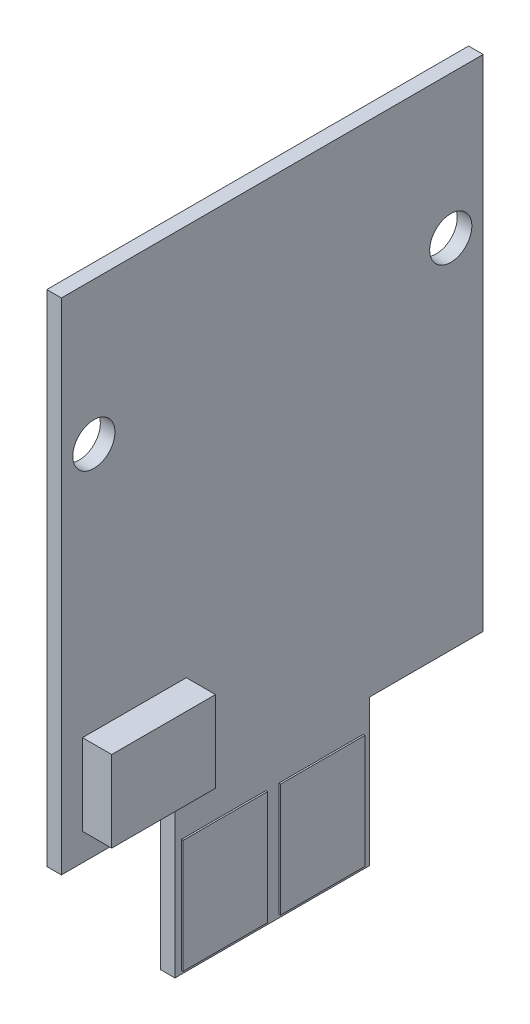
ISO-10303-21;
HEADER;
FILE_DESCRIPTION(('STEP AP214'),'2;1');
FILE_NAME('part.step','',(''),(''),'','','');
FILE_SCHEMA(('AUTOMOTIVE_DESIGN { 1 0 10303 214 1 1 1 1 }'));
ENDSEC;
DATA;
#1=APPLICATION_CONTEXT('core data for automotive mechanical design processes');
#2=APPLICATION_PROTOCOL_DEFINITION('international standard','automotive_design',2000,#1);
#3=PRODUCT_CONTEXT('',#1,'mechanical');
#4=PRODUCT('Part','Part','',(#3));
#5=PRODUCT_RELATED_PRODUCT_CATEGORY('part','',(#4));
#6=PRODUCT_DEFINITION_FORMATION('','',#4);
#7=PRODUCT_DEFINITION_CONTEXT('part definition',#1,'design');
#8=PRODUCT_DEFINITION('design','',#6,#7);
#9=PRODUCT_DEFINITION_SHAPE('','',#8);
#10=(LENGTH_UNIT() NAMED_UNIT(*) SI_UNIT(.MILLI.,.METRE.));
#11=(NAMED_UNIT(*) PLANE_ANGLE_UNIT() SI_UNIT($,.RADIAN.));
#12=(NAMED_UNIT(*) SI_UNIT($,.STERADIAN.) SOLID_ANGLE_UNIT());
#13=UNCERTAINTY_MEASURE_WITH_UNIT(LENGTH_MEASURE(1.E-05),#10,'distance_accuracy_value','');
#14=(GEOMETRIC_REPRESENTATION_CONTEXT(3) GLOBAL_UNCERTAINTY_ASSIGNED_CONTEXT((#13)) GLOBAL_UNIT_ASSIGNED_CONTEXT((#10,
#11,#12)) REPRESENTATION_CONTEXT('',''));
#15=CARTESIAN_POINT('',(0.,0.,0.));
#16=DIRECTION('',(0.,0.,1.));
#17=DIRECTION('',(1.,0.,0.));
#18=AXIS2_PLACEMENT_3D('',#15,#16,#17);
#19=CARTESIAN_POINT('',(-2.921242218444,-9.16,36.8684));
#20=DIRECTION('',(0.,-1.,0.));
#21=DIRECTION('',(0.,0.,1.));
#22=AXIS2_PLACEMENT_3D('',#19,#20,#21);
#23=PLANE('',#22);
#24=DIRECTION('',(0.,0.,1.));
#25=VECTOR('',#24,1.);
#26=CARTESIAN_POINT('',(-3.65,-9.16,42.11));
#27=LINE('',#26,#25);
#28=CARTESIAN_POINT('',(-3.65,-9.16,47.15));
#29=VERTEX_POINT('',#28);
#30=CARTESIAN_POINT('',(-3.65,-9.16,37.07));
#31=VERTEX_POINT('',#30);
#32=EDGE_CURVE('E203',#29,#31,#27,.F.);
#33=ORIENTED_EDGE('',*,*,#32,.T.);
#34=DIRECTION('',(1.,0.,0.));
#35=VECTOR('',#34,1.);
#36=CARTESIAN_POINT('',(-3.3,-9.16,37.07));
#37=LINE('',#36,#35);
#38=CARTESIAN_POINT('',(-2.95,-9.16,37.07));
#39=VERTEX_POINT('',#38);
#40=EDGE_CURVE('E199',#39,#31,#37,.F.);
#41=ORIENTED_EDGE('',*,*,#40,.F.);
#42=DIRECTION('',(0.,0.,-1.));
#43=VECTOR('',#42,1.);
#44=CARTESIAN_POINT('',(-2.95,-9.16,42.11));
#45=LINE('',#44,#43);
#46=CARTESIAN_POINT('',(-2.95,-9.16,47.15));
#47=VERTEX_POINT('',#46);
#48=EDGE_CURVE('E201',#39,#47,#45,.F.);
#49=ORIENTED_EDGE('',*,*,#48,.T.);
#50=DIRECTION('',(-1.,0.,0.));
#51=VECTOR('',#50,1.);
#52=CARTESIAN_POINT('',(-3.3,-9.16,47.15));
#53=LINE('',#52,#51);
#54=EDGE_CURVE('E208',#29,#47,#53,.F.);
#55=ORIENTED_EDGE('',*,*,#54,.F.);
#56=EDGE_LOOP('',(#33,#41,#49,#55));
#57=FACE_BOUND('',#56,.T.);
#58=ADVANCED_FACE('F16',(#57),#23,.T.);
#59=CARTESIAN_POINT('',(-2.921242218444,-4.66,47.3516));
#60=DIRECTION('',(0.,1.,0.));
#61=DIRECTION('',(0.,0.,-1.));
#62=AXIS2_PLACEMENT_3D('',#59,#60,#61);
#63=PLANE('',#62);
#64=DIRECTION('',(0.,0.,-1.));
#65=VECTOR('',#64,1.);
#66=CARTESIAN_POINT('',(-3.65,-4.66,42.11));
#67=LINE('',#66,#65);
#68=CARTESIAN_POINT('',(-3.65,-4.66,37.07));
#69=VERTEX_POINT('',#68);
#70=CARTESIAN_POINT('',(-3.65,-4.66,47.15));
#71=VERTEX_POINT('',#70);
#72=EDGE_CURVE('E234',#69,#71,#67,.F.);
#73=ORIENTED_EDGE('',*,*,#72,.T.);
#74=DIRECTION('',(1.,0.,0.));
#75=VECTOR('',#74,1.);
#76=CARTESIAN_POINT('',(-3.3,-4.66,47.15));
#77=LINE('',#76,#75);
#78=CARTESIAN_POINT('',(-2.95,-4.66,47.15));
#79=VERTEX_POINT('',#78);
#80=EDGE_CURVE('E239',#79,#71,#77,.F.);
#81=ORIENTED_EDGE('',*,*,#80,.F.);
#82=DIRECTION('',(0.,0.,1.));
#83=VECTOR('',#82,1.);
#84=CARTESIAN_POINT('',(-2.95,-4.66,42.11));
#85=LINE('',#84,#83);
#86=CARTESIAN_POINT('',(-2.95,-4.66,37.07));
#87=VERTEX_POINT('',#86);
#88=EDGE_CURVE('E224',#79,#87,#85,.F.);
#89=ORIENTED_EDGE('',*,*,#88,.T.);
#90=DIRECTION('',(-1.,0.,0.));
#91=VECTOR('',#90,1.);
#92=CARTESIAN_POINT('',(-3.3,-4.66,37.07));
#93=LINE('',#92,#91);
#94=EDGE_CURVE('E217',#69,#87,#93,.F.);
#95=ORIENTED_EDGE('',*,*,#94,.F.);
#96=EDGE_LOOP('',(#73,#81,#89,#95));
#97=FACE_BOUND('',#96,.T.);
#98=ADVANCED_FACE('F387',(#97),#63,.T.);
#99=CARTESIAN_POINT('',(-2.95,-9.5,36.8684));
#100=DIRECTION('',(-1.,0.,0.));
#101=DIRECTION('',(0.,0.,1.));
#102=AXIS2_PLACEMENT_3D('',#99,#100,#101);
#103=PLANE('',#102);
#104=DIRECTION('',(0.,0.,-1.));
#105=VECTOR('',#104,1.);
#106=CARTESIAN_POINT('',(-2.95,-9.4,42.11));
#107=LINE('',#106,#105);
#108=CARTESIAN_POINT('',(-2.95,-9.4,37.07));
#109=VERTEX_POINT('',#108);
#110=CARTESIAN_POINT('',(-2.95,-9.4,47.15));
#111=VERTEX_POINT('',#110);
#112=EDGE_CURVE('E378',#109,#111,#107,.F.);
#113=ORIENTED_EDGE('',*,*,#112,.T.);
#114=DIRECTION('',(0.,1.,0.));
#115=VECTOR('',#114,1.);
#116=CARTESIAN_POINT('',(-2.95,-6.9,47.15));
#117=LINE('',#116,#115);
#118=EDGE_CURVE('E216',#47,#111,#117,.F.);
#119=ORIENTED_EDGE('',*,*,#118,.F.);
#120=ORIENTED_EDGE('',*,*,#48,.F.);
#121=DIRECTION('',(0.,1.,0.));
#122=VECTOR('',#121,1.);
#123=CARTESIAN_POINT('',(-2.95,-6.9,37.07));
#124=LINE('',#123,#122);
#125=EDGE_CURVE('E214',#39,#109,#124,.F.);
#126=ORIENTED_EDGE('',*,*,#125,.T.);
#127=EDGE_LOOP('',(#113,#119,#120,#126));
#128=FACE_BOUND('',#127,.T.);
#129=ADVANCED_FACE('F213',(#128),#103,.T.);
#130=CARTESIAN_POINT('',(-3.65,-9.25,36.8684));
#131=DIRECTION('',(-1.,0.,0.));
#132=DIRECTION('',(0.,0.,1.));
#133=AXIS2_PLACEMENT_3D('',#130,#131,#132);
#134=PLANE('',#133);
#135=DIRECTION('',(0.,-1.,0.));
#136=VECTOR('',#135,1.);
#137=CARTESIAN_POINT('',(-3.65,-6.9,47.15));
#138=LINE('',#137,#136);
#139=EDGE_CURVE('E370',#29,#71,#138,.F.);
#140=ORIENTED_EDGE('',*,*,#139,.T.);
#141=ORIENTED_EDGE('',*,*,#72,.F.);
#142=DIRECTION('',(0.,1.,0.));
#143=VECTOR('',#142,1.);
#144=CARTESIAN_POINT('',(-3.65,-6.9,37.07));
#145=LINE('',#144,#143);
#146=EDGE_CURVE('E227',#69,#31,#145,.F.);
#147=ORIENTED_EDGE('',*,*,#146,.T.);
#148=ORIENTED_EDGE('',*,*,#32,.F.);
#149=EDGE_LOOP('',(#140,#141,#147,#148));
#150=FACE_BOUND('',#149,.T.);
#151=ADVANCED_FACE('F382',(#150),#134,.T.);
#152=CARTESIAN_POINT('',(-2.95,-9.5,36.8684));
#153=DIRECTION('',(-1.,0.,0.));
#154=DIRECTION('',(0.,0.,1.));
#155=AXIS2_PLACEMENT_3D('',#152,#153,#154);
#156=PLANE('',#155);
#157=DIRECTION('',(0.,0.,1.));
#158=VECTOR('',#157,1.);
#159=CARTESIAN_POINT('',(-2.95,-4.4,42.11));
#160=LINE('',#159,#158);
#161=CARTESIAN_POINT('',(-2.95,-4.4,47.15));
#162=VERTEX_POINT('',#161);
#163=CARTESIAN_POINT('',(-2.95,-4.4,37.07));
#164=VERTEX_POINT('',#163);
#165=EDGE_CURVE('E364',#162,#164,#160,.F.);
#166=ORIENTED_EDGE('',*,*,#165,.T.);
#167=DIRECTION('',(0.,1.,0.));
#168=VECTOR('',#167,1.);
#169=CARTESIAN_POINT('',(-2.95,-6.9,37.07));
#170=LINE('',#169,#168);
#171=EDGE_CURVE('E223',#164,#87,#170,.F.);
#172=ORIENTED_EDGE('',*,*,#171,.T.);
#173=ORIENTED_EDGE('',*,*,#88,.F.);
#174=DIRECTION('',(0.,-1.,0.));
#175=VECTOR('',#174,1.);
#176=CARTESIAN_POINT('',(-2.95,-6.9,47.15));
#177=LINE('',#176,#175);
#178=EDGE_CURVE('E376',#79,#162,#177,.F.);
#179=ORIENTED_EDGE('',*,*,#178,.T.);
#180=EDGE_LOOP('',(#166,#172,#173,#179));
#181=FACE_BOUND('',#180,.T.);
#182=ADVANCED_FACE('F390',(#181),#156,.T.);
#183=CARTESIAN_POINT('',(-1.916,-4.3,37.07));
#184=DIRECTION('',(0.,0.,-1.));
#185=DIRECTION('',(0.,-1.,0.));
#186=AXIS2_PLACEMENT_3D('',#183,#184,#185);
#187=PLANE('',#186);
#188=ORIENTED_EDGE('',*,*,#94,.T.);
#189=ORIENTED_EDGE('',*,*,#171,.F.);
#190=DIRECTION('',(-1.,0.,0.));
#191=VECTOR('',#190,1.);
#192=CARTESIAN_POINT('',(-2.45,-4.4,37.07));
#193=LINE('',#192,#191);
#194=CARTESIAN_POINT('',(-1.95,-4.4,37.07));
#195=VERTEX_POINT('',#194);
#196=EDGE_CURVE('E361',#164,#195,#193,.F.);
#197=ORIENTED_EDGE('',*,*,#196,.T.);
#198=DIRECTION('',(0.,1.,0.));
#199=VECTOR('',#198,1.);
#200=CARTESIAN_POINT('',(-1.95,-5.55,37.07));
#201=LINE('',#200,#199);
#202=CARTESIAN_POINT('',(-1.95,-9.4,37.07));
#203=VERTEX_POINT('',#202);
#204=EDGE_CURVE('E359',#195,#203,#201,.F.);
#205=ORIENTED_EDGE('',*,*,#204,.T.);
#206=DIRECTION('',(1.,0.,0.));
#207=VECTOR('',#206,1.);
#208=CARTESIAN_POINT('',(-2.45,-9.4,37.07));
#209=LINE('',#208,#207);
#210=EDGE_CURVE('E222',#203,#109,#209,.F.);
#211=ORIENTED_EDGE('',*,*,#210,.T.);
#212=ORIENTED_EDGE('',*,*,#125,.F.);
#213=ORIENTED_EDGE('',*,*,#40,.T.);
#214=ORIENTED_EDGE('',*,*,#146,.F.);
#215=EDGE_LOOP('',(#188,#189,#197,#205,#211,#212,#213,#214));
#216=FACE_BOUND('',#215,.T.);
#217=ADVANCED_FACE('F220',(#216),#187,.T.);
#218=CARTESIAN_POINT('',(-1.921242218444,-9.4,36.8684));
#219=DIRECTION('',(0.,-1.,0.));
#220=DIRECTION('',(0.,0.,1.));
#221=AXIS2_PLACEMENT_3D('',#218,#219,#220);
#222=PLANE('',#221);
#223=ORIENTED_EDGE('',*,*,#112,.F.);
#224=ORIENTED_EDGE('',*,*,#210,.F.);
#225=DIRECTION('',(0.,0.,-1.));
#226=VECTOR('',#225,1.);
#227=CARTESIAN_POINT('',(-1.95,-9.4,43.35));
#228=LINE('',#227,#226);
#229=CARTESIAN_POINT('',(-1.95,-9.4,47.15));
#230=VERTEX_POINT('',#229);
#231=EDGE_CURVE('E356',#203,#230,#228,.F.);
#232=ORIENTED_EDGE('',*,*,#231,.T.);
#233=DIRECTION('',(1.,0.,0.));
#234=VECTOR('',#233,1.);
#235=CARTESIAN_POINT('',(-2.8,-9.4,47.15));
#236=LINE('',#235,#234);
#237=EDGE_CURVE('E373',#230,#111,#236,.F.);
#238=ORIENTED_EDGE('',*,*,#237,.T.);
#239=EDGE_LOOP('',(#223,#224,#232,#238));
#240=FACE_BOUND('',#239,.T.);
#241=ADVANCED_FACE('F402',(#240),#222,.T.);
#242=CARTESIAN_POINT('',(-1.916,-9.5,47.15));
#243=DIRECTION('',(0.,0.,1.));
#244=DIRECTION('',(0.,1.,0.));
#245=AXIS2_PLACEMENT_3D('',#242,#243,#244);
#246=PLANE('',#245);
#247=ORIENTED_EDGE('',*,*,#54,.T.);
#248=ORIENTED_EDGE('',*,*,#118,.T.);
#249=ORIENTED_EDGE('',*,*,#237,.F.);
#250=DIRECTION('',(0.,-1.,0.));
#251=VECTOR('',#250,1.);
#252=CARTESIAN_POINT('',(-1.95,-5.55,47.15));
#253=LINE('',#252,#251);
#254=CARTESIAN_POINT('',(-1.95,-4.4,47.15));
#255=VERTEX_POINT('',#254);
#256=EDGE_CURVE('E353',#230,#255,#253,.F.);
#257=ORIENTED_EDGE('',*,*,#256,.T.);
#258=DIRECTION('',(1.,0.,0.));
#259=VECTOR('',#258,1.);
#260=CARTESIAN_POINT('',(-2.45,-4.4,47.15));
#261=LINE('',#260,#259);
#262=EDGE_CURVE('E367',#255,#162,#261,.F.);
#263=ORIENTED_EDGE('',*,*,#262,.T.);
#264=ORIENTED_EDGE('',*,*,#178,.F.);
#265=ORIENTED_EDGE('',*,*,#80,.T.);
#266=ORIENTED_EDGE('',*,*,#139,.F.);
#267=EDGE_LOOP('',(#247,#248,#249,#257,#263,#264,#265,#266));
#268=FACE_BOUND('',#267,.T.);
#269=ADVANCED_FACE('F396',(#268),#246,.T.);
#270=CARTESIAN_POINT('',(-1.921242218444,-4.4,47.3516));
#271=DIRECTION('',(0.,1.,0.));
#272=DIRECTION('',(0.,0.,-1.));
#273=AXIS2_PLACEMENT_3D('',#270,#271,#272);
#274=PLANE('',#273);
#275=ORIENTED_EDGE('',*,*,#165,.F.);
#276=ORIENTED_EDGE('',*,*,#262,.F.);
#277=DIRECTION('',(0.,0.,1.));
#278=VECTOR('',#277,1.);
#279=CARTESIAN_POINT('',(-1.95,-4.4,43.35));
#280=LINE('',#279,#278);
#281=EDGE_CURVE('E350',#255,#195,#280,.F.);
#282=ORIENTED_EDGE('',*,*,#281,.T.);
#283=ORIENTED_EDGE('',*,*,#196,.F.);
#284=EDGE_LOOP('',(#275,#276,#282,#283));
#285=FACE_BOUND('',#284,.T.);
#286=ADVANCED_FACE('F393',(#285),#274,.T.);
#287=CARTESIAN_POINT('',(-1.45,-15.47,40.438));
#288=DIRECTION('',(1.,0.,0.));
#289=DIRECTION('',(0.,1.,0.));
#290=AXIS2_PLACEMENT_3D('',#287,#288,#289);
#291=PLANE('',#290);
#292=DIRECTION('',(0.,1.,0.));
#293=VECTOR('',#292,1.);
#294=CARTESIAN_POINT('',(-1.45,-13.65,43.15));
#295=LINE('',#294,#293);
#296=CARTESIAN_POINT('',(-1.45,-11.9,43.15));
#297=VERTEX_POINT('',#296);
#298=CARTESIAN_POINT('',(-1.45,-15.4,43.15));
#299=VERTEX_POINT('',#298);
#300=EDGE_CURVE('E296',#297,#299,#295,.F.);
#301=ORIENTED_EDGE('',*,*,#300,.T.);
#302=DIRECTION('',(0.,0.,1.));
#303=VECTOR('',#302,1.);
#304=CARTESIAN_POINT('',(-1.45,-15.4,41.85));
#305=LINE('',#304,#303);
#306=CARTESIAN_POINT('',(-1.45,-15.4,40.55));
#307=VERTEX_POINT('',#306);
#308=EDGE_CURVE('E290',#299,#307,#305,.F.);
#309=ORIENTED_EDGE('',*,*,#308,.T.);
#310=DIRECTION('',(0.,-1.,0.));
#311=VECTOR('',#310,1.);
#312=CARTESIAN_POINT('',(-1.45,-13.65,40.55));
#313=LINE('',#312,#311);
#314=CARTESIAN_POINT('',(-1.45,-11.9,40.55));
#315=VERTEX_POINT('',#314);
#316=EDGE_CURVE('E306',#307,#315,#313,.F.);
#317=ORIENTED_EDGE('',*,*,#316,.T.);
#318=DIRECTION('',(0.,0.,-1.));
#319=VECTOR('',#318,1.);
#320=CARTESIAN_POINT('',(-1.45,-11.9,41.85));
#321=LINE('',#320,#319);
#322=EDGE_CURVE('E301',#315,#297,#321,.F.);
#323=ORIENTED_EDGE('',*,*,#322,.T.);
#324=EDGE_LOOP('',(#301,#309,#317,#323));
#325=FACE_BOUND('',#324,.T.);
#326=ADVANCED_FACE('F648',(#325),#291,.T.);
#327=CARTESIAN_POINT('',(-1.45,-15.47,40.438));
#328=DIRECTION('',(1.,0.,0.));
#329=DIRECTION('',(0.,1.,0.));
#330=AXIS2_PLACEMENT_3D('',#327,#328,#329);
#331=PLANE('',#330);
#332=DIRECTION('',(0.,0.,-1.));
#333=VECTOR('',#332,1.);
#334=CARTESIAN_POINT('',(-1.45,-11.9,44.85));
#335=LINE('',#334,#333);
#336=CARTESIAN_POINT('',(-1.45,-11.9,43.55));
#337=VERTEX_POINT('',#336);
#338=CARTESIAN_POINT('',(-1.45,-11.9,46.15));
#339=VERTEX_POINT('',#338);
#340=EDGE_CURVE('E275',#337,#339,#335,.F.);
#341=ORIENTED_EDGE('',*,*,#340,.T.);
#342=DIRECTION('',(0.,1.,0.));
#343=VECTOR('',#342,1.);
#344=CARTESIAN_POINT('',(-1.45,-13.65,46.15));
#345=LINE('',#344,#343);
#346=CARTESIAN_POINT('',(-1.45,-15.4,46.15));
#347=VERTEX_POINT('',#346);
#348=EDGE_CURVE('E262',#339,#347,#345,.F.);
#349=ORIENTED_EDGE('',*,*,#348,.T.);
#350=DIRECTION('',(0.,0.,1.));
#351=VECTOR('',#350,1.);
#352=CARTESIAN_POINT('',(-1.45,-15.4,44.85));
#353=LINE('',#352,#351);
#354=CARTESIAN_POINT('',(-1.45,-15.4,43.55));
#355=VERTEX_POINT('',#354);
#356=EDGE_CURVE('E285',#347,#355,#353,.F.);
#357=ORIENTED_EDGE('',*,*,#356,.T.);
#358=DIRECTION('',(0.,-1.,0.));
#359=VECTOR('',#358,1.);
#360=CARTESIAN_POINT('',(-1.45,-13.65,43.55));
#361=LINE('',#360,#359);
#362=EDGE_CURVE('E280',#355,#337,#361,.F.);
#363=ORIENTED_EDGE('',*,*,#362,.T.);
#364=EDGE_LOOP('',(#341,#349,#357,#363));
#365=FACE_BOUND('',#364,.T.);
#366=ADVANCED_FACE('F636',(#365),#331,.T.);
#367=CARTESIAN_POINT('',(-1.95,4.798,50.11));
#368=DIRECTION('',(-1.,0.,0.));
#369=DIRECTION('',(0.,0.,-1.));
#370=AXIS2_PLACEMENT_3D('',#367,#368,#369);
#371=PLANE('',#370);
#372=ORIENTED_EDGE('',*,*,#256,.F.);
#373=ORIENTED_EDGE('',*,*,#231,.F.);
#374=ORIENTED_EDGE('',*,*,#204,.F.);
#375=ORIENTED_EDGE('',*,*,#281,.F.);
#376=EDGE_LOOP('',(#372,#373,#374,#375));
#377=FACE_BOUND('',#376,.T.);
#378=CARTESIAN_POINT('',(-1.95,0.,48.85));
#379=DIRECTION('',(1.,0.,0.));
#380=DIRECTION('',(0.,0.,-1.));
#381=AXIS2_PLACEMENT_3D('',#378,#379,#380);
#382=CIRCLE('',#381,0.65);
#383=CARTESIAN_POINT('',(-1.95,0.,48.2));
#384=VERTEX_POINT('',#383);
#385=EDGE_CURVE('E250',#384,#384,#382,.T.);
#386=ORIENTED_EDGE('',*,*,#385,.T.);
#387=EDGE_LOOP('',(#386));
#388=FACE_BOUND('',#387,.T.);
#389=CARTESIAN_POINT('',(-1.95,0.,37.85));
#390=DIRECTION('',(-1.,0.,0.));
#391=DIRECTION('',(0.,0.,1.));
#392=AXIS2_PLACEMENT_3D('',#389,#390,#391);
#393=CIRCLE('',#392,0.65);
#394=CARTESIAN_POINT('',(-1.95,0.,38.5));
#395=VERTEX_POINT('',#394);
#396=EDGE_CURVE('E20',#395,#395,#393,.F.);
#397=ORIENTED_EDGE('',*,*,#396,.T.);
#398=EDGE_LOOP('',(#397));
#399=FACE_BOUND('',#398,.T.);
#400=DIRECTION('',(0.,1.,0.));
#401=VECTOR('',#400,1.);
#402=CARTESIAN_POINT('',(-1.95,-13.25,40.35));
#403=LINE('',#402,#401);
#404=CARTESIAN_POINT('',(-1.95,-11.,40.35));
#405=VERTEX_POINT('',#404);
#406=CARTESIAN_POINT('',(-1.95,-15.5,40.35));
#407=VERTEX_POINT('',#406);
#408=EDGE_CURVE('E327',#405,#407,#403,.F.);
#409=ORIENTED_EDGE('',*,*,#408,.T.);
#410=DIRECTION('',(0.,0.,-1.));
#411=VECTOR('',#410,1.);
#412=CARTESIAN_POINT('',(-1.95,-15.5,43.35));
#413=LINE('',#412,#411);
#414=CARTESIAN_POINT('',(-1.95,-15.5,46.35));
#415=VERTEX_POINT('',#414);
#416=EDGE_CURVE('E322',#407,#415,#413,.F.);
#417=ORIENTED_EDGE('',*,*,#416,.T.);
#418=DIRECTION('',(0.,-1.,0.));
#419=VECTOR('',#418,1.);
#420=CARTESIAN_POINT('',(-1.95,-13.25,46.35));
#421=LINE('',#420,#419);
#422=CARTESIAN_POINT('',(-1.95,-11.,46.35));
#423=VERTEX_POINT('',#422);
#424=EDGE_CURVE('E317',#415,#423,#421,.F.);
#425=ORIENTED_EDGE('',*,*,#424,.T.);
#426=DIRECTION('',(0.,0.,-1.));
#427=VECTOR('',#426,1.);
#428=CARTESIAN_POINT('',(-1.95,-11.,43.35));
#429=LINE('',#428,#427);
#430=CARTESIAN_POINT('',(-1.95,-11.,49.85));
#431=VERTEX_POINT('',#430);
#432=EDGE_CURVE('E311',#423,#431,#429,.F.);
#433=ORIENTED_EDGE('',*,*,#432,.T.);
#434=DIRECTION('',(0.,-1.,0.));
#435=VECTOR('',#434,1.);
#436=CARTESIAN_POINT('',(-1.95,-3.3,49.85));
#437=LINE('',#436,#435);
#438=CARTESIAN_POINT('',(-1.95,4.4,49.85));
#439=VERTEX_POINT('',#438);
#440=EDGE_CURVE('E347',#431,#439,#437,.F.);
#441=ORIENTED_EDGE('',*,*,#440,.T.);
#442=DIRECTION('',(0.,0.,1.));
#443=VECTOR('',#442,1.);
#444=CARTESIAN_POINT('',(-1.95,4.4,43.35));
#445=LINE('',#444,#443);
#446=CARTESIAN_POINT('',(-1.95,4.4,36.85));
#447=VERTEX_POINT('',#446);
#448=EDGE_CURVE('E345',#439,#447,#445,.F.);
#449=ORIENTED_EDGE('',*,*,#448,.T.);
#450=DIRECTION('',(0.,1.,0.));
#451=VECTOR('',#450,1.);
#452=CARTESIAN_POINT('',(-1.95,-3.3,36.85));
#453=LINE('',#452,#451);
#454=CARTESIAN_POINT('',(-1.95,-11.,36.85));
#455=VERTEX_POINT('',#454);
#456=EDGE_CURVE('E337',#447,#455,#453,.F.);
#457=ORIENTED_EDGE('',*,*,#456,.T.);
#458=DIRECTION('',(0.,0.,-1.));
#459=VECTOR('',#458,1.);
#460=CARTESIAN_POINT('',(-1.95,-11.,43.35));
#461=LINE('',#460,#459);
#462=EDGE_CURVE('E332',#455,#405,#461,.F.);
#463=ORIENTED_EDGE('',*,*,#462,.T.);
#464=EDGE_LOOP('',(#409,#417,#425,#433,#441,#449,#457,#463));
#465=FACE_BOUND('',#464,.T.);
#466=ADVANCED_FACE('F400',(#377,#388,#399,#465),#371,.T.);
#467=CARTESIAN_POINT('',(-0.6,-10.21,49.264));
#468=DIRECTION('',(1.,0.,0.));
#469=DIRECTION('',(0.,0.,-1.));
#470=AXIS2_PLACEMENT_3D('',#467,#468,#469);
#471=PLANE('',#470);
#472=DIRECTION('',(0.,-1.,0.));
#473=VECTOR('',#472,1.);
#474=CARTESIAN_POINT('',(-0.6,-8.91,46.));
#475=LINE('',#474,#473);
#476=CARTESIAN_POINT('',(-0.6,-10.16,46.));
#477=VERTEX_POINT('',#476);
#478=CARTESIAN_POINT('',(-0.6,-7.66,46.));
#479=VERTEX_POINT('',#478);
#480=EDGE_CURVE('E482',#477,#479,#475,.F.);
#481=ORIENTED_EDGE('',*,*,#480,.T.);
#482=DIRECTION('',(0.,0.,-1.));
#483=VECTOR('',#482,1.);
#484=CARTESIAN_POINT('',(-0.6,-7.66,47.6));
#485=LINE('',#484,#483);
#486=CARTESIAN_POINT('',(-0.6,-7.66,49.2));
#487=VERTEX_POINT('',#486);
#488=EDGE_CURVE('E478',#479,#487,#485,.F.);
#489=ORIENTED_EDGE('',*,*,#488,.T.);
#490=DIRECTION('',(0.,1.,0.));
#491=VECTOR('',#490,1.);
#492=CARTESIAN_POINT('',(-0.6,-8.91,49.2));
#493=LINE('',#492,#491);
#494=CARTESIAN_POINT('',(-0.6,-10.16,49.2));
#495=VERTEX_POINT('',#494);
#496=EDGE_CURVE('E252',#487,#495,#493,.F.);
#497=ORIENTED_EDGE('',*,*,#496,.T.);
#498=DIRECTION('',(0.,0.,1.));
#499=VECTOR('',#498,1.);
#500=CARTESIAN_POINT('',(-0.6,-10.16,47.6));
#501=LINE('',#500,#499);
#502=EDGE_CURVE('E487',#495,#477,#501,.F.);
#503=ORIENTED_EDGE('',*,*,#502,.T.);
#504=EDGE_LOOP('',(#481,#489,#497,#503));
#505=FACE_BOUND('',#504,.T.);
#506=ADVANCED_FACE('F539',(#505),#471,.T.);
#507=CARTESIAN_POINT('',(-1.471242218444,-11.308,49.85));
#508=DIRECTION('',(0.,0.,1.));
#509=DIRECTION('',(0.,1.,0.));
#510=AXIS2_PLACEMENT_3D('',#507,#508,#509);
#511=PLANE('',#510);
#512=DIRECTION('',(0.,1.,0.));
#513=VECTOR('',#512,1.);
#514=CARTESIAN_POINT('',(-1.5,-5.55,49.85));
#515=LINE('',#514,#513);
#516=CARTESIAN_POINT('',(-1.5,-11.,49.85));
#517=VERTEX_POINT('',#516);
#518=CARTESIAN_POINT('',(-1.5,4.4,49.85));
#519=VERTEX_POINT('',#518);
#520=EDGE_CURVE('E472',#517,#519,#515,.T.);
#521=ORIENTED_EDGE('',*,*,#520,.T.);
#522=DIRECTION('',(1.,0.,0.));
#523=VECTOR('',#522,1.);
#524=CARTESIAN_POINT('',(-1.725,4.4,49.85));
#525=LINE('',#524,#523);
#526=EDGE_CURVE('E342',#519,#439,#525,.F.);
#527=ORIENTED_EDGE('',*,*,#526,.T.);
#528=ORIENTED_EDGE('',*,*,#440,.F.);
#529=DIRECTION('',(-1.,0.,0.));
#530=VECTOR('',#529,1.);
#531=CARTESIAN_POINT('',(-1.725,-11.,49.85));
#532=LINE('',#531,#530);
#533=EDGE_CURVE('E308',#431,#517,#532,.F.);
#534=ORIENTED_EDGE('',*,*,#533,.T.);
#535=EDGE_LOOP('',(#521,#527,#528,#534));
#536=FACE_BOUND('',#535,.T.);
#537=ADVANCED_FACE('F537',(#536),#511,.T.);
#538=CARTESIAN_POINT('',(-1.471242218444,4.4,50.11));
#539=DIRECTION('',(0.,1.,0.));
#540=DIRECTION('',(0.,0.,-1.));
#541=AXIS2_PLACEMENT_3D('',#538,#539,#540);
#542=PLANE('',#541);
#543=DIRECTION('',(0.,0.,-1.));
#544=VECTOR('',#543,1.);
#545=CARTESIAN_POINT('',(-1.5,4.4,43.35));
#546=LINE('',#545,#544);
#547=CARTESIAN_POINT('',(-1.5,4.4,36.85));
#548=VERTEX_POINT('',#547);
#549=EDGE_CURVE('E469',#519,#548,#546,.T.);
#550=ORIENTED_EDGE('',*,*,#549,.T.);
#551=DIRECTION('',(1.,0.,0.));
#552=VECTOR('',#551,1.);
#553=CARTESIAN_POINT('',(-1.725,4.4,36.85));
#554=LINE('',#553,#552);
#555=EDGE_CURVE('E339',#548,#447,#554,.F.);
#556=ORIENTED_EDGE('',*,*,#555,.T.);
#557=ORIENTED_EDGE('',*,*,#448,.F.);
#558=ORIENTED_EDGE('',*,*,#526,.F.);
#559=EDGE_LOOP('',(#550,#556,#557,#558));
#560=FACE_BOUND('',#559,.T.);
#561=ADVANCED_FACE('F535',(#560),#542,.T.);
#562=CARTESIAN_POINT('',(-1.471242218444,4.708,36.85));
#563=DIRECTION('',(0.,0.,-1.));
#564=DIRECTION('',(0.,-1.,0.));
#565=AXIS2_PLACEMENT_3D('',#562,#563,#564);
#566=PLANE('',#565);
#567=ORIENTED_EDGE('',*,*,#456,.F.);
#568=ORIENTED_EDGE('',*,*,#555,.F.);
#569=DIRECTION('',(0.,-1.,0.));
#570=VECTOR('',#569,1.);
#571=CARTESIAN_POINT('',(-1.5,-5.55,36.85));
#572=LINE('',#571,#570);
#573=CARTESIAN_POINT('',(-1.5,-11.,36.85));
#574=VERTEX_POINT('',#573);
#575=EDGE_CURVE('E466',#548,#574,#572,.T.);
#576=ORIENTED_EDGE('',*,*,#575,.T.);
#577=DIRECTION('',(1.,0.,0.));
#578=VECTOR('',#577,1.);
#579=CARTESIAN_POINT('',(-1.725,-11.,36.85));
#580=LINE('',#579,#578);
#581=EDGE_CURVE('E334',#574,#455,#580,.F.);
#582=ORIENTED_EDGE('',*,*,#581,.T.);
#583=EDGE_LOOP('',(#567,#568,#576,#582));
#584=FACE_BOUND('',#583,.T.);
#585=ADVANCED_FACE('F532',(#584),#566,.T.);
#586=CARTESIAN_POINT('',(-1.471242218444,-11.,36.59));
#587=DIRECTION('',(0.,-1.,0.));
#588=DIRECTION('',(0.,0.,1.));
#589=AXIS2_PLACEMENT_3D('',#586,#587,#588);
#590=PLANE('',#589);
#591=ORIENTED_EDGE('',*,*,#581,.F.);
#592=DIRECTION('',(0.,0.,1.));
#593=VECTOR('',#592,1.);
#594=CARTESIAN_POINT('',(-1.5,-11.,43.35));
#595=LINE('',#594,#593);
#596=CARTESIAN_POINT('',(-1.5,-11.,40.35));
#597=VERTEX_POINT('',#596);
#598=EDGE_CURVE('E460',#574,#597,#595,.T.);
#599=ORIENTED_EDGE('',*,*,#598,.T.);
#600=DIRECTION('',(1.,0.,0.));
#601=VECTOR('',#600,1.);
#602=CARTESIAN_POINT('',(-1.725,-11.,40.35));
#603=LINE('',#602,#601);
#604=EDGE_CURVE('E329',#597,#405,#603,.F.);
#605=ORIENTED_EDGE('',*,*,#604,.T.);
#606=ORIENTED_EDGE('',*,*,#462,.F.);
#607=EDGE_LOOP('',(#591,#599,#605,#606));
#608=FACE_BOUND('',#607,.T.);
#609=ADVANCED_FACE('F528',(#608),#590,.T.);
#610=CARTESIAN_POINT('',(-1.978757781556,-15.59,40.35));
#611=DIRECTION('',(0.,0.,-1.));
#612=DIRECTION('',(0.,1.,0.));
#613=AXIS2_PLACEMENT_3D('',#610,#611,#612);
#614=PLANE('',#613);
#615=DIRECTION('',(1.,0.,0.));
#616=VECTOR('',#615,1.);
#617=CARTESIAN_POINT('',(-1.725,-15.5,40.35));
#618=LINE('',#617,#616);
#619=CARTESIAN_POINT('',(-1.5,-15.5,40.35));
#620=VERTEX_POINT('',#619);
#621=EDGE_CURVE('E324',#620,#407,#618,.F.);
#622=ORIENTED_EDGE('',*,*,#621,.T.);
#623=ORIENTED_EDGE('',*,*,#408,.F.);
#624=ORIENTED_EDGE('',*,*,#604,.F.);
#625=DIRECTION('',(0.,-1.,0.));
#626=VECTOR('',#625,1.);
#627=CARTESIAN_POINT('',(-1.5,-5.55,40.35));
#628=LINE('',#627,#626);
#629=EDGE_CURVE('E458',#597,#620,#628,.T.);
#630=ORIENTED_EDGE('',*,*,#629,.T.);
#631=EDGE_LOOP('',(#622,#623,#624,#630));
#632=FACE_BOUND('',#631,.T.);
#633=ADVANCED_FACE('F524',(#632),#614,.T.);
#634=CARTESIAN_POINT('',(-1.978757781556,-15.5,46.47));
#635=DIRECTION('',(0.,-1.,0.));
#636=DIRECTION('',(0.,0.,-1.));
#637=AXIS2_PLACEMENT_3D('',#634,#635,#636);
#638=PLANE('',#637);
#639=ORIENTED_EDGE('',*,*,#416,.F.);
#640=ORIENTED_EDGE('',*,*,#621,.F.);
#641=DIRECTION('',(0.,0.,1.));
#642=VECTOR('',#641,1.);
#643=CARTESIAN_POINT('',(-1.5,-15.5,43.35));
#644=LINE('',#643,#642);
#645=CARTESIAN_POINT('',(-1.5,-15.5,46.35));
#646=VERTEX_POINT('',#645);
#647=EDGE_CURVE('E449',#620,#646,#644,.T.);
#648=ORIENTED_EDGE('',*,*,#647,.T.);
#649=DIRECTION('',(1.,0.,0.));
#650=VECTOR('',#649,1.);
#651=CARTESIAN_POINT('',(-1.725,-15.5,46.35));
#652=LINE('',#651,#650);
#653=EDGE_CURVE('E319',#646,#415,#652,.F.);
#654=ORIENTED_EDGE('',*,*,#653,.T.);
#655=EDGE_LOOP('',(#639,#640,#648,#654));
#656=FACE_BOUND('',#655,.T.);
#657=ADVANCED_FACE('F457',(#656),#638,.T.);
#658=CARTESIAN_POINT('',(-1.978757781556,-10.91,46.35));
#659=DIRECTION('',(0.,0.,1.));
#660=DIRECTION('',(0.,-1.,0.));
#661=AXIS2_PLACEMENT_3D('',#658,#659,#660);
#662=PLANE('',#661);
#663=ORIENTED_EDGE('',*,*,#653,.F.);
#664=DIRECTION('',(0.,1.,0.));
#665=VECTOR('',#664,1.);
#666=CARTESIAN_POINT('',(-1.5,-5.55,46.35));
#667=LINE('',#666,#665);
#668=CARTESIAN_POINT('',(-1.5,-11.,46.35));
#669=VERTEX_POINT('',#668);
#670=EDGE_CURVE('E446',#646,#669,#667,.T.);
#671=ORIENTED_EDGE('',*,*,#670,.T.);
#672=DIRECTION('',(1.,0.,0.));
#673=VECTOR('',#672,1.);
#674=CARTESIAN_POINT('',(-1.725,-11.,46.35));
#675=LINE('',#674,#673);
#676=EDGE_CURVE('E314',#669,#423,#675,.F.);
#677=ORIENTED_EDGE('',*,*,#676,.T.);
#678=ORIENTED_EDGE('',*,*,#424,.F.);
#679=EDGE_LOOP('',(#663,#671,#677,#678));
#680=FACE_BOUND('',#679,.T.);
#681=ADVANCED_FACE('F520',(#680),#662,.T.);
#682=CARTESIAN_POINT('',(-1.471242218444,-11.,36.59));
#683=DIRECTION('',(0.,-1.,0.));
#684=DIRECTION('',(0.,0.,1.));
#685=AXIS2_PLACEMENT_3D('',#682,#683,#684);
#686=PLANE('',#685);
#687=ORIENTED_EDGE('',*,*,#533,.F.);
#688=ORIENTED_EDGE('',*,*,#432,.F.);
#689=ORIENTED_EDGE('',*,*,#676,.F.);
#690=DIRECTION('',(0.,0.,1.));
#691=VECTOR('',#690,1.);
#692=CARTESIAN_POINT('',(-1.5,-11.,43.35));
#693=LINE('',#692,#691);
#694=EDGE_CURVE('E452',#669,#517,#693,.T.);
#695=ORIENTED_EDGE('',*,*,#694,.T.);
#696=EDGE_LOOP('',(#687,#688,#689,#695));
#697=FACE_BOUND('',#696,.T.);
#698=ADVANCED_FACE('F517',(#697),#686,.T.);
#699=CARTESIAN_POINT('',(-1.528757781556,-15.47,40.55));
#700=DIRECTION('',(0.,0.,-1.));
#701=DIRECTION('',(0.,1.,0.));
#702=AXIS2_PLACEMENT_3D('',#699,#700,#701);
#703=PLANE('',#702);
#704=ORIENTED_EDGE('',*,*,#316,.F.);
#705=DIRECTION('',(1.,0.,0.));
#706=VECTOR('',#705,1.);
#707=CARTESIAN_POINT('',(-1.475,-15.4,40.55));
#708=LINE('',#707,#706);
#709=CARTESIAN_POINT('',(-1.5,-15.4,40.55));
#710=VERTEX_POINT('',#709);
#711=EDGE_CURVE('E287',#307,#710,#708,.F.);
#712=ORIENTED_EDGE('',*,*,#711,.T.);
#713=DIRECTION('',(0.,1.,0.));
#714=VECTOR('',#713,1.);
#715=CARTESIAN_POINT('',(-1.5,-5.55,40.55));
#716=LINE('',#715,#714);
#717=CARTESIAN_POINT('',(-1.5,-11.9,40.55));
#718=VERTEX_POINT('',#717);
#719=EDGE_CURVE('E513',#710,#718,#716,.T.);
#720=ORIENTED_EDGE('',*,*,#719,.T.);
#721=DIRECTION('',(-1.,0.,0.));
#722=VECTOR('',#721,1.);
#723=CARTESIAN_POINT('',(-1.475,-11.9,40.55));
#724=LINE('',#723,#722);
#725=EDGE_CURVE('E303',#718,#315,#724,.F.);
#726=ORIENTED_EDGE('',*,*,#725,.T.);
#727=EDGE_LOOP('',(#704,#712,#720,#726));
#728=FACE_BOUND('',#727,.T.);
#729=ADVANCED_FACE('F562',(#728),#703,.T.);
#730=CARTESIAN_POINT('',(-1.528757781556,-11.9,40.498));
#731=DIRECTION('',(0.,1.,0.));
#732=DIRECTION('',(0.,0.,1.));
#733=AXIS2_PLACEMENT_3D('',#730,#731,#732);
#734=PLANE('',#733);
#735=ORIENTED_EDGE('',*,*,#322,.F.);
#736=ORIENTED_EDGE('',*,*,#725,.F.);
#737=DIRECTION('',(0.,0.,1.));
#738=VECTOR('',#737,1.);
#739=CARTESIAN_POINT('',(-1.5,-11.9,43.35));
#740=LINE('',#739,#738);
#741=CARTESIAN_POINT('',(-1.5,-11.9,43.15));
#742=VERTEX_POINT('',#741);
#743=EDGE_CURVE('E511',#718,#742,#740,.T.);
#744=ORIENTED_EDGE('',*,*,#743,.T.);
#745=DIRECTION('',(-1.,0.,0.));
#746=VECTOR('',#745,1.);
#747=CARTESIAN_POINT('',(-1.475,-11.9,43.15));
#748=LINE('',#747,#746);
#749=EDGE_CURVE('E298',#742,#297,#748,.F.);
#750=ORIENTED_EDGE('',*,*,#749,.T.);
#751=EDGE_LOOP('',(#735,#736,#744,#750));
#752=FACE_BOUND('',#751,.T.);
#753=ADVANCED_FACE('F565',(#752),#734,.T.);
#754=CARTESIAN_POINT('',(-1.528757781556,-11.83,43.15));
#755=DIRECTION('',(0.,0.,1.));
#756=DIRECTION('',(0.,-1.,0.));
#757=AXIS2_PLACEMENT_3D('',#754,#755,#756);
#758=PLANE('',#757);
#759=ORIENTED_EDGE('',*,*,#300,.F.);
#760=ORIENTED_EDGE('',*,*,#749,.F.);
#761=DIRECTION('',(0.,-1.,0.));
#762=VECTOR('',#761,1.);
#763=CARTESIAN_POINT('',(-1.5,-5.55,43.15));
#764=LINE('',#763,#762);
#765=CARTESIAN_POINT('',(-1.5,-15.4,43.15));
#766=VERTEX_POINT('',#765);
#767=EDGE_CURVE('E440',#742,#766,#764,.T.);
#768=ORIENTED_EDGE('',*,*,#767,.T.);
#769=DIRECTION('',(-1.,0.,0.));
#770=VECTOR('',#769,1.);
#771=CARTESIAN_POINT('',(-1.475,-15.4,43.15));
#772=LINE('',#771,#770);
#773=EDGE_CURVE('E293',#766,#299,#772,.F.);
#774=ORIENTED_EDGE('',*,*,#773,.T.);
#775=EDGE_LOOP('',(#759,#760,#768,#774));
#776=FACE_BOUND('',#775,.T.);
#777=ADVANCED_FACE('F569',(#776),#758,.T.);
#778=CARTESIAN_POINT('',(-1.528757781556,-15.4,43.202));
#779=DIRECTION('',(0.,-1.,0.));
#780=DIRECTION('',(0.,0.,-1.));
#781=AXIS2_PLACEMENT_3D('',#778,#779,#780);
#782=PLANE('',#781);
#783=ORIENTED_EDGE('',*,*,#308,.F.);
#784=ORIENTED_EDGE('',*,*,#773,.F.);
#785=DIRECTION('',(0.,0.,-1.));
#786=VECTOR('',#785,1.);
#787=CARTESIAN_POINT('',(-1.5,-15.4,43.35));
#788=LINE('',#787,#786);
#789=EDGE_CURVE('E507',#766,#710,#788,.T.);
#790=ORIENTED_EDGE('',*,*,#789,.T.);
#791=ORIENTED_EDGE('',*,*,#711,.F.);
#792=EDGE_LOOP('',(#783,#784,#790,#791));
#793=FACE_BOUND('',#792,.T.);
#794=ADVANCED_FACE('F573',(#793),#782,.T.);
#795=CARTESIAN_POINT('',(-1.528757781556,-15.4,46.202));
#796=DIRECTION('',(0.,-1.,0.));
#797=DIRECTION('',(0.,0.,-1.));
#798=AXIS2_PLACEMENT_3D('',#795,#796,#797);
#799=PLANE('',#798);
#800=ORIENTED_EDGE('',*,*,#356,.F.);
#801=DIRECTION('',(1.,0.,0.));
#802=VECTOR('',#801,1.);
#803=CARTESIAN_POINT('',(-1.475,-15.4,46.15));
#804=LINE('',#803,#802);
#805=CARTESIAN_POINT('',(-1.5,-15.4,46.15));
#806=VERTEX_POINT('',#805);
#807=EDGE_CURVE('E258',#347,#806,#804,.F.);
#808=ORIENTED_EDGE('',*,*,#807,.T.);
#809=DIRECTION('',(0.,0.,-1.));
#810=VECTOR('',#809,1.);
#811=CARTESIAN_POINT('',(-1.5,-15.4,43.35));
#812=LINE('',#811,#810);
#813=CARTESIAN_POINT('',(-1.5,-15.4,43.55));
#814=VERTEX_POINT('',#813);
#815=EDGE_CURVE('E505',#806,#814,#812,.T.);
#816=ORIENTED_EDGE('',*,*,#815,.T.);
#817=DIRECTION('',(-1.,0.,0.));
#818=VECTOR('',#817,1.);
#819=CARTESIAN_POINT('',(-1.475,-15.4,43.55));
#820=LINE('',#819,#818);
#821=EDGE_CURVE('E282',#814,#355,#820,.F.);
#822=ORIENTED_EDGE('',*,*,#821,.T.);
#823=EDGE_LOOP('',(#800,#808,#816,#822));
#824=FACE_BOUND('',#823,.T.);
#825=ADVANCED_FACE('F577',(#824),#799,.T.);
#826=CARTESIAN_POINT('',(-1.528757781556,-15.47,43.55));
#827=DIRECTION('',(0.,0.,-1.));
#828=DIRECTION('',(0.,1.,0.));
#829=AXIS2_PLACEMENT_3D('',#826,#827,#828);
#830=PLANE('',#829);
#831=ORIENTED_EDGE('',*,*,#362,.F.);
#832=ORIENTED_EDGE('',*,*,#821,.F.);
#833=DIRECTION('',(0.,1.,0.));
#834=VECTOR('',#833,1.);
#835=CARTESIAN_POINT('',(-1.5,-5.55,43.55));
#836=LINE('',#835,#834);
#837=CARTESIAN_POINT('',(-1.5,-11.9,43.55));
#838=VERTEX_POINT('',#837);
#839=EDGE_CURVE('E503',#814,#838,#836,.T.);
#840=ORIENTED_EDGE('',*,*,#839,.T.);
#841=DIRECTION('',(-1.,0.,0.));
#842=VECTOR('',#841,1.);
#843=CARTESIAN_POINT('',(-1.475,-11.9,43.55));
#844=LINE('',#843,#842);
#845=EDGE_CURVE('E277',#838,#337,#844,.F.);
#846=ORIENTED_EDGE('',*,*,#845,.T.);
#847=EDGE_LOOP('',(#831,#832,#840,#846));
#848=FACE_BOUND('',#847,.T.);
#849=ADVANCED_FACE('F581',(#848),#830,.T.);
#850=CARTESIAN_POINT('',(-1.528757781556,-11.9,43.498));
#851=DIRECTION('',(0.,1.,0.));
#852=DIRECTION('',(0.,0.,1.));
#853=AXIS2_PLACEMENT_3D('',#850,#851,#852);
#854=PLANE('',#853);
#855=ORIENTED_EDGE('',*,*,#340,.F.);
#856=ORIENTED_EDGE('',*,*,#845,.F.);
#857=DIRECTION('',(0.,0.,1.));
#858=VECTOR('',#857,1.);
#859=CARTESIAN_POINT('',(-1.5,-11.9,43.35));
#860=LINE('',#859,#858);
#861=CARTESIAN_POINT('',(-1.5,-11.9,46.15));
#862=VERTEX_POINT('',#861);
#863=EDGE_CURVE('E433',#838,#862,#860,.T.);
#864=ORIENTED_EDGE('',*,*,#863,.T.);
#865=DIRECTION('',(-1.,0.,0.));
#866=VECTOR('',#865,1.);
#867=CARTESIAN_POINT('',(-1.475,-11.9,46.15));
#868=LINE('',#867,#866);
#869=EDGE_CURVE('E269',#862,#339,#868,.F.);
#870=ORIENTED_EDGE('',*,*,#869,.T.);
#871=EDGE_LOOP('',(#855,#856,#864,#870));
#872=FACE_BOUND('',#871,.T.);
#873=ADVANCED_FACE('F584',(#872),#854,.T.);
#874=CARTESIAN_POINT('',(-1.528757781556,-11.83,46.15));
#875=DIRECTION('',(0.,0.,1.));
#876=DIRECTION('',(0.,-1.,0.));
#877=AXIS2_PLACEMENT_3D('',#874,#875,#876);
#878=PLANE('',#877);
#879=ORIENTED_EDGE('',*,*,#348,.F.);
#880=ORIENTED_EDGE('',*,*,#869,.F.);
#881=DIRECTION('',(0.,-1.,0.));
#882=VECTOR('',#881,1.);
#883=CARTESIAN_POINT('',(-1.5,-5.55,46.15));
#884=LINE('',#883,#882);
#885=EDGE_CURVE('E249',#862,#806,#884,.T.);
#886=ORIENTED_EDGE('',*,*,#885,.T.);
#887=ORIENTED_EDGE('',*,*,#807,.F.);
#888=EDGE_LOOP('',(#879,#880,#886,#887));
#889=FACE_BOUND('',#888,.T.);
#890=ADVANCED_FACE('F588',(#889),#878,.T.);
#891=CARTESIAN_POINT('',(-1.5,0.,37.85));
#892=DIRECTION('',(-1.,0.,0.));
#893=DIRECTION('',(0.,0.,1.));
#894=AXIS2_PLACEMENT_3D('',#891,#892,#893);
#895=CYLINDRICAL_SURFACE('',#894,0.65);
#896=ORIENTED_EDGE('',*,*,#396,.F.);
#897=EDGE_LOOP('',(#896));
#898=FACE_BOUND('',#897,.T.);
#899=CARTESIAN_POINT('',(-1.5,0.,37.85));
#900=DIRECTION('',(-1.,0.,0.));
#901=DIRECTION('',(0.,0.,1.));
#902=AXIS2_PLACEMENT_3D('',#899,#900,#901);
#903=CIRCLE('',#902,0.65);
#904=CARTESIAN_POINT('',(-1.5,0.,38.5));
#905=VERTEX_POINT('',#904);
#906=EDGE_CURVE('E247',#905,#905,#903,.F.);
#907=ORIENTED_EDGE('',*,*,#906,.T.);
#908=EDGE_LOOP('',(#907));
#909=FACE_BOUND('',#908,.T.);
#910=ADVANCED_FACE('F592',(#898,#909),#895,.F.);
#911=CARTESIAN_POINT('',(-1.95,0.,48.85));
#912=DIRECTION('',(1.,0.,0.));
#913=DIRECTION('',(0.,0.,-1.));
#914=AXIS2_PLACEMENT_3D('',#911,#912,#913);
#915=CYLINDRICAL_SURFACE('',#914,0.65);
#916=ORIENTED_EDGE('',*,*,#385,.F.);
#917=EDGE_LOOP('',(#916));
#918=FACE_BOUND('',#917,.T.);
#919=CARTESIAN_POINT('',(-1.5,0.,48.85));
#920=DIRECTION('',(1.,0.,0.));
#921=DIRECTION('',(0.,0.,-1.));
#922=AXIS2_PLACEMENT_3D('',#919,#920,#921);
#923=CIRCLE('',#922,0.65);
#924=CARTESIAN_POINT('',(-1.5,0.,48.2));
#925=VERTEX_POINT('',#924);
#926=EDGE_CURVE('E243',#925,#925,#923,.T.);
#927=ORIENTED_EDGE('',*,*,#926,.T.);
#928=EDGE_LOOP('',(#927));
#929=FACE_BOUND('',#928,.T.);
#930=ADVANCED_FACE('F596',(#918,#929),#915,.F.);
#931=CARTESIAN_POINT('',(-1.528757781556,-7.61,49.2));
#932=DIRECTION('',(0.,0.,1.));
#933=DIRECTION('',(0.,-1.,0.));
#934=AXIS2_PLACEMENT_3D('',#931,#932,#933);
#935=PLANE('',#934);
#936=ORIENTED_EDGE('',*,*,#496,.F.);
#937=DIRECTION('',(1.,0.,0.));
#938=VECTOR('',#937,1.);
#939=CARTESIAN_POINT('',(-1.0500000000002,-7.66,49.2));
#940=LINE('',#939,#938);
#941=CARTESIAN_POINT('',(-1.5,-7.66,49.2));
#942=VERTEX_POINT('',#941);
#943=EDGE_CURVE('E475',#487,#942,#940,.F.);
#944=ORIENTED_EDGE('',*,*,#943,.T.);
#945=DIRECTION('',(0.,-1.,0.));
#946=VECTOR('',#945,1.);
#947=CARTESIAN_POINT('',(-1.5,-5.55,49.2));
#948=LINE('',#947,#946);
#949=CARTESIAN_POINT('',(-1.5,-10.16,49.2));
#950=VERTEX_POINT('',#949);
#951=EDGE_CURVE('E246',#942,#950,#948,.T.);
#952=ORIENTED_EDGE('',*,*,#951,.T.);
#953=DIRECTION('',(-1.,0.,0.));
#954=VECTOR('',#953,1.);
#955=CARTESIAN_POINT('',(-1.0500000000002,-10.16,49.2));
#956=LINE('',#955,#954);
#957=EDGE_CURVE('E255',#950,#495,#956,.F.);
#958=ORIENTED_EDGE('',*,*,#957,.T.);
#959=EDGE_LOOP('',(#936,#944,#952,#958));
#960=FACE_BOUND('',#959,.T.);
#961=ADVANCED_FACE('F491',(#960),#935,.T.);
#962=CARTESIAN_POINT('',(-1.528757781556,-10.16,49.264));
#963=DIRECTION('',(0.,-1.,0.));
#964=DIRECTION('',(0.,0.,-1.));
#965=AXIS2_PLACEMENT_3D('',#962,#963,#964);
#966=PLANE('',#965);
#967=ORIENTED_EDGE('',*,*,#502,.F.);
#968=ORIENTED_EDGE('',*,*,#957,.F.);
#969=DIRECTION('',(0.,0.,-1.));
#970=VECTOR('',#969,1.);
#971=CARTESIAN_POINT('',(-1.5,-10.16,43.35));
#972=LINE('',#971,#970);
#973=CARTESIAN_POINT('',(-1.5,-10.16,46.));
#974=VERTEX_POINT('',#973);
#975=EDGE_CURVE('E496',#950,#974,#972,.T.);
#976=ORIENTED_EDGE('',*,*,#975,.T.);
#977=DIRECTION('',(-1.,0.,0.));
#978=VECTOR('',#977,1.);
#979=CARTESIAN_POINT('',(-1.0500000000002,-10.16,46.));
#980=LINE('',#979,#978);
#981=EDGE_CURVE('E484',#974,#477,#980,.F.);
#982=ORIENTED_EDGE('',*,*,#981,.T.);
#983=EDGE_LOOP('',(#967,#968,#976,#982));
#984=FACE_BOUND('',#983,.T.);
#985=ADVANCED_FACE('F495',(#984),#966,.T.);
#986=CARTESIAN_POINT('',(-1.528757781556,-10.21,46.));
#987=DIRECTION('',(0.,0.,-1.));
#988=DIRECTION('',(0.,1.,0.));
#989=AXIS2_PLACEMENT_3D('',#986,#987,#988);
#990=PLANE('',#989);
#991=ORIENTED_EDGE('',*,*,#480,.F.);
#992=ORIENTED_EDGE('',*,*,#981,.F.);
#993=DIRECTION('',(0.,1.,0.));
#994=VECTOR('',#993,1.);
#995=CARTESIAN_POINT('',(-1.5,-5.55,46.));
#996=LINE('',#995,#994);
#997=CARTESIAN_POINT('',(-1.5,-7.66,46.));
#998=VERTEX_POINT('',#997);
#999=EDGE_CURVE('E26',#974,#998,#996,.T.);
#1000=ORIENTED_EDGE('',*,*,#999,.T.);
#1001=DIRECTION('',(-1.,0.,0.));
#1002=VECTOR('',#1001,1.);
#1003=CARTESIAN_POINT('',(-1.0500000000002,-7.66,46.));
#1004=LINE('',#1003,#1002);
#1005=EDGE_CURVE('E34',#998,#479,#1004,.F.);
#1006=ORIENTED_EDGE('',*,*,#1005,.T.);
#1007=EDGE_LOOP('',(#991,#992,#1000,#1006));
#1008=FACE_BOUND('',#1007,.T.);
#1009=ADVANCED_FACE('F418',(#1008),#990,.T.);
#1010=CARTESIAN_POINT('',(-1.528757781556,-7.66,45.936));
#1011=DIRECTION('',(0.,1.,0.));
#1012=DIRECTION('',(0.,0.,1.));
#1013=AXIS2_PLACEMENT_3D('',#1010,#1011,#1012);
#1014=PLANE('',#1013);
#1015=ORIENTED_EDGE('',*,*,#488,.F.);
#1016=ORIENTED_EDGE('',*,*,#1005,.F.);
#1017=DIRECTION('',(0.,0.,1.));
#1018=VECTOR('',#1017,1.);
#1019=CARTESIAN_POINT('',(-1.5,-7.66,43.35));
#1020=LINE('',#1019,#1018);
#1021=EDGE_CURVE('E11',#998,#942,#1020,.T.);
#1022=ORIENTED_EDGE('',*,*,#1021,.T.);
#1023=ORIENTED_EDGE('',*,*,#943,.F.);
#1024=EDGE_LOOP('',(#1015,#1016,#1022,#1023));
#1025=FACE_BOUND('',#1024,.T.);
#1026=ADVANCED_FACE('F413',(#1025),#1014,.T.);
#1027=CARTESIAN_POINT('',(-1.5,4.798,50.11));
#1028=DIRECTION('',(-1.,0.,0.));
#1029=DIRECTION('',(0.,0.,-1.));
#1030=AXIS2_PLACEMENT_3D('',#1027,#1028,#1029);
#1031=PLANE('',#1030);
#1032=ORIENTED_EDGE('',*,*,#999,.F.);
#1033=ORIENTED_EDGE('',*,*,#975,.F.);
#1034=ORIENTED_EDGE('',*,*,#951,.F.);
#1035=ORIENTED_EDGE('',*,*,#1021,.F.);
#1036=EDGE_LOOP('',(#1032,#1033,#1034,#1035));
#1037=FACE_BOUND('',#1036,.T.);
#1038=ORIENTED_EDGE('',*,*,#926,.F.);
#1039=EDGE_LOOP('',(#1038));
#1040=FACE_BOUND('',#1039,.T.);
#1041=ORIENTED_EDGE('',*,*,#906,.F.);
#1042=EDGE_LOOP('',(#1041));
#1043=FACE_BOUND('',#1042,.T.);
#1044=ORIENTED_EDGE('',*,*,#863,.F.);
#1045=ORIENTED_EDGE('',*,*,#839,.F.);
#1046=ORIENTED_EDGE('',*,*,#815,.F.);
#1047=ORIENTED_EDGE('',*,*,#885,.F.);
#1048=EDGE_LOOP('',(#1044,#1045,#1046,#1047));
#1049=FACE_BOUND('',#1048,.T.);
#1050=ORIENTED_EDGE('',*,*,#767,.F.);
#1051=ORIENTED_EDGE('',*,*,#743,.F.);
#1052=ORIENTED_EDGE('',*,*,#719,.F.);
#1053=ORIENTED_EDGE('',*,*,#789,.F.);
#1054=EDGE_LOOP('',(#1050,#1051,#1052,#1053));
#1055=FACE_BOUND('',#1054,.T.);
#1056=ORIENTED_EDGE('',*,*,#670,.F.);
#1057=ORIENTED_EDGE('',*,*,#647,.F.);
#1058=ORIENTED_EDGE('',*,*,#629,.F.);
#1059=ORIENTED_EDGE('',*,*,#598,.F.);
#1060=ORIENTED_EDGE('',*,*,#575,.F.);
#1061=ORIENTED_EDGE('',*,*,#549,.F.);
#1062=ORIENTED_EDGE('',*,*,#520,.F.);
#1063=ORIENTED_EDGE('',*,*,#694,.F.);
#1064=EDGE_LOOP('',(#1056,#1057,#1058,#1059,#1060,#1061,#1062,#1063));
#1065=FACE_BOUND('',#1064,.T.);
#1066=ADVANCED_FACE('F18',(#1037,#1040,#1043,#1049,#1055,#1065),#1031,.F.);
#1067=CLOSED_SHELL('',(#58,#98,#129,#151,#182,#217,#241,#269,#286,#326,#366,#466,#506,#537,#561,
#585,#609,#633,#657,#681,#698,#729,#753,#777,#794,#825,#849,#873,#890,#910,#930,#961,#985,#1009,
#1026,#1066));
#1068=MANIFOLD_SOLID_BREP('B1',#1067);
#1069=ADVANCED_BREP_SHAPE_REPRESENTATION('',(#18,#1068),#14);
#1070=SHAPE_DEFINITION_REPRESENTATION(#9,#1069);
ENDSEC;
END-ISO-10303-21;
